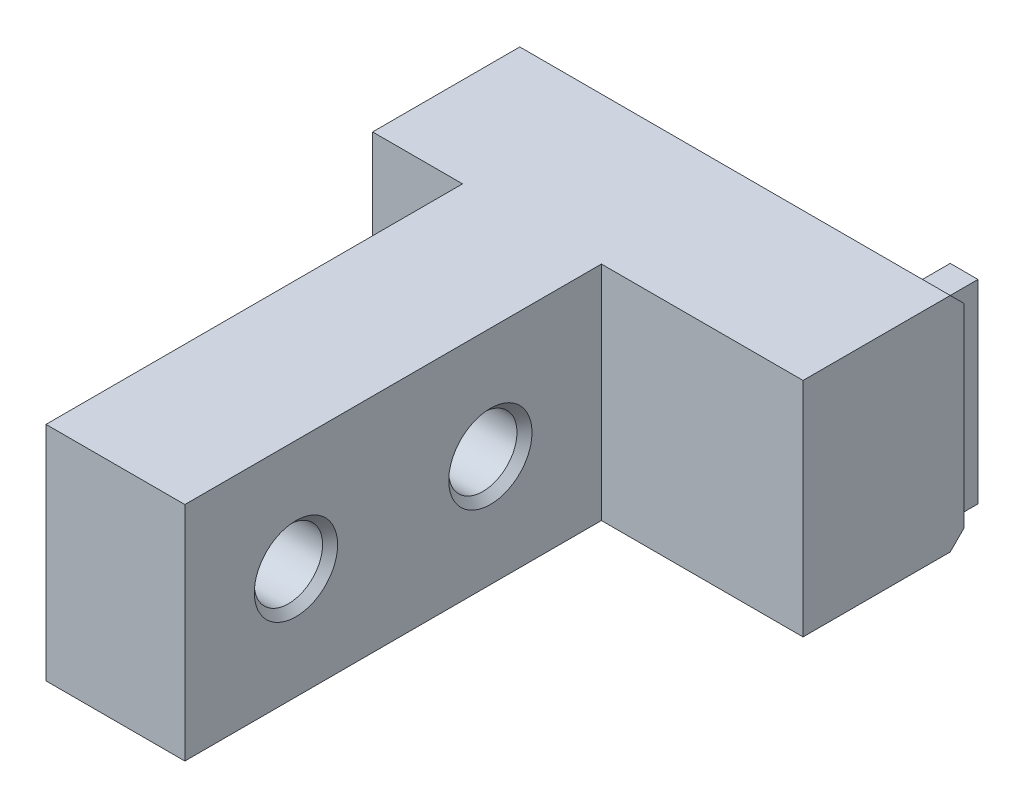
ISO-10303-21;
HEADER;
FILE_DESCRIPTION(('STEP AP214'),'2;1');
FILE_NAME('part.step','',(''),(''),'','','');
FILE_SCHEMA(('AUTOMOTIVE_DESIGN { 1 0 10303 214 1 1 1 1 }'));
ENDSEC;
DATA;
#1=APPLICATION_CONTEXT('core data for automotive mechanical design processes');
#2=APPLICATION_PROTOCOL_DEFINITION('international standard','automotive_design',2000,#1);
#3=PRODUCT_CONTEXT('',#1,'mechanical');
#4=PRODUCT('Part','Part','',(#3));
#5=PRODUCT_RELATED_PRODUCT_CATEGORY('part','',(#4));
#6=PRODUCT_DEFINITION_FORMATION('','',#4);
#7=PRODUCT_DEFINITION_CONTEXT('part definition',#1,'design');
#8=PRODUCT_DEFINITION('design','',#6,#7);
#9=PRODUCT_DEFINITION_SHAPE('','',#8);
#10=(LENGTH_UNIT() NAMED_UNIT(*) SI_UNIT(.MILLI.,.METRE.));
#11=(NAMED_UNIT(*) PLANE_ANGLE_UNIT() SI_UNIT($,.RADIAN.));
#12=(NAMED_UNIT(*) SI_UNIT($,.STERADIAN.) SOLID_ANGLE_UNIT());
#13=UNCERTAINTY_MEASURE_WITH_UNIT(LENGTH_MEASURE(1.E-05),#10,'distance_accuracy_value','');
#14=(GEOMETRIC_REPRESENTATION_CONTEXT(3) GLOBAL_UNCERTAINTY_ASSIGNED_CONTEXT((#13)) GLOBAL_UNIT_ASSIGNED_CONTEXT((#10,
#11,#12)) REPRESENTATION_CONTEXT('',''));
#15=CARTESIAN_POINT('',(0.,0.,0.));
#16=DIRECTION('',(0.,0.,1.));
#17=DIRECTION('',(1.,0.,0.));
#18=AXIS2_PLACEMENT_3D('',#15,#16,#17);
#19=CARTESIAN_POINT('',(-4.69,-3.5,-1.));
#20=DIRECTION('',(0.,0.,-1.));
#21=DIRECTION('',(-1.,0.,0.));
#22=AXIS2_PLACEMENT_3D('',#19,#20,#21);
#23=PLANE('',#22);
#24=DIRECTION('',(0.,1.,0.));
#25=VECTOR('',#24,1.);
#26=CARTESIAN_POINT('',(-4.69,0.,-1.));
#27=LINE('',#26,#25);
#28=CARTESIAN_POINT('',(-4.69,-3.5,-1.));
#29=VERTEX_POINT('',#28);
#30=CARTESIAN_POINT('',(-4.69,3.5,-1.));
#31=VERTEX_POINT('',#30);
#32=EDGE_CURVE('E120',#29,#31,#27,.T.);
#33=ORIENTED_EDGE('',*,*,#32,.T.);
#34=DIRECTION('',(-1.,0.,0.));
#35=VECTOR('',#34,1.);
#36=CARTESIAN_POINT('',(-4.69,3.5,-1.));
#37=LINE('',#36,#35);
#38=CARTESIAN_POINT('',(-3.69,3.5,-1.));
#39=VERTEX_POINT('',#38);
#40=EDGE_CURVE('E126',#31,#39,#37,.F.);
#41=ORIENTED_EDGE('',*,*,#40,.T.);
#42=DIRECTION('',(0.,1.,0.));
#43=VECTOR('',#42,1.);
#44=CARTESIAN_POINT('',(-3.69,0.,-1.));
#45=LINE('',#44,#43);
#46=CARTESIAN_POINT('',(-3.69,-3.5,-1.));
#47=VERTEX_POINT('',#46);
#48=EDGE_CURVE('E123',#47,#39,#45,.T.);
#49=ORIENTED_EDGE('',*,*,#48,.F.);
#50=DIRECTION('',(1.,0.,0.));
#51=VECTOR('',#50,1.);
#52=CARTESIAN_POINT('',(-4.69,-3.5,-1.));
#53=LINE('',#52,#51);
#54=EDGE_CURVE('E115',#29,#47,#53,.T.);
#55=ORIENTED_EDGE('',*,*,#54,.F.);
#56=EDGE_LOOP('',(#33,#41,#49,#55));
#57=FACE_BOUND('',#56,.T.);
#58=ADVANCED_FACE('F17',(#57),#23,.T.);
#59=CARTESIAN_POINT('',(-4.69,-3.5,0.));
#60=DIRECTION('',(0.,-1.,0.));
#61=DIRECTION('',(0.,0.,-1.));
#62=AXIS2_PLACEMENT_3D('',#59,#60,#61);
#63=PLANE('',#62);
#64=DIRECTION('',(0.,0.,-1.));
#65=VECTOR('',#64,1.);
#66=CARTESIAN_POINT('',(-4.69,-3.5,0.));
#67=LINE('',#66,#65);
#68=CARTESIAN_POINT('',(-4.69,-3.5,0.));
#69=VERTEX_POINT('',#68);
#70=EDGE_CURVE('E125',#69,#29,#67,.T.);
#71=ORIENTED_EDGE('',*,*,#70,.T.);
#72=ORIENTED_EDGE('',*,*,#54,.T.);
#73=DIRECTION('',(0.,0.,-1.));
#74=VECTOR('',#73,1.);
#75=CARTESIAN_POINT('',(-3.69,-3.5,0.));
#76=LINE('',#75,#74);
#77=CARTESIAN_POINT('',(-3.69,-3.5,0.));
#78=VERTEX_POINT('',#77);
#79=EDGE_CURVE('E139',#78,#47,#76,.T.);
#80=ORIENTED_EDGE('',*,*,#79,.F.);
#81=DIRECTION('',(1.,0.,0.));
#82=VECTOR('',#81,1.);
#83=CARTESIAN_POINT('',(-18.69,-3.5,0.));
#84=LINE('',#83,#82);
#85=EDGE_CURVE('E131',#78,#69,#84,.F.);
#86=ORIENTED_EDGE('',*,*,#85,.T.);
#87=EDGE_LOOP('',(#71,#72,#80,#86));
#88=FACE_BOUND('',#87,.T.);
#89=ADVANCED_FACE('F129',(#88),#63,.T.);
#90=CARTESIAN_POINT('',(-4.69,0.,0.));
#91=DIRECTION('',(1.,0.,0.));
#92=DIRECTION('',(0.,0.,-1.));
#93=AXIS2_PLACEMENT_3D('',#90,#91,#92);
#94=PLANE('',#93);
#95=DIRECTION('',(0.,0.,1.));
#96=VECTOR('',#95,1.);
#97=CARTESIAN_POINT('',(-4.69,3.5,-1.));
#98=LINE('',#97,#96);
#99=CARTESIAN_POINT('',(-4.69,3.5,0.));
#100=VERTEX_POINT('',#99);
#101=EDGE_CURVE('E138',#31,#100,#98,.T.);
#102=ORIENTED_EDGE('',*,*,#101,.F.);
#103=ORIENTED_EDGE('',*,*,#32,.F.);
#104=ORIENTED_EDGE('',*,*,#70,.F.);
#105=DIRECTION('',(0.,1.,0.));
#106=VECTOR('',#105,1.);
#107=CARTESIAN_POINT('',(-4.69,4.,0.));
#108=LINE('',#107,#106);
#109=EDGE_CURVE('E203',#69,#100,#108,.T.);
#110=ORIENTED_EDGE('',*,*,#109,.T.);
#111=EDGE_LOOP('',(#102,#103,#104,#110));
#112=FACE_BOUND('',#111,.T.);
#113=ADVANCED_FACE('F136',(#112),#94,.F.);
#114=CARTESIAN_POINT('',(-15.45,0.,16.8));
#115=DIRECTION('',(1.,0.,0.));
#116=DIRECTION('',(0.,0.,-1.));
#117=AXIS2_PLACEMENT_3D('',#114,#115,#116);
#118=CYLINDRICAL_SURFACE('',#117,1.2295);
#119=CARTESIAN_POINT('',(-15.1794999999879,0.,16.8));
#120=DIRECTION('',(-1.,0.,0.));
#121=DIRECTION('',(0.,0.,1.));
#122=AXIS2_PLACEMENT_3D('',#119,#120,#121);
#123=CIRCLE('',#122,1.22950000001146);
#124=CARTESIAN_POINT('',(-15.1794999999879,0.,18.0295000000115));
#125=VERTEX_POINT('',#124);
#126=EDGE_CURVE('E143',#125,#125,#123,.T.);
#127=ORIENTED_EDGE('',*,*,#126,.T.);
#128=EDGE_LOOP('',(#127));
#129=FACE_BOUND('',#128,.T.);
#130=CARTESIAN_POINT('',(-10.720499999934,0.,16.8));
#131=DIRECTION('',(1.,0.,0.));
#132=DIRECTION('',(0.,0.,-1.));
#133=AXIS2_PLACEMENT_3D('',#130,#131,#132);
#134=CIRCLE('',#133,1.22950000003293);
#135=CARTESIAN_POINT('',(-10.720499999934,0.,15.5704999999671));
#136=VERTEX_POINT('',#135);
#137=EDGE_CURVE('E219',#136,#136,#134,.T.);
#138=ORIENTED_EDGE('',*,*,#137,.T.);
#139=EDGE_LOOP('',(#138));
#140=FACE_BOUND('',#139,.T.);
#141=ADVANCED_FACE('F228',(#129,#140),#118,.F.);
#142=CARTESIAN_POINT('',(-15.45,0.,9.8));
#143=DIRECTION('',(1.,0.,0.));
#144=DIRECTION('',(0.,0.,-1.));
#145=AXIS2_PLACEMENT_3D('',#142,#143,#144);
#146=CYLINDRICAL_SURFACE('',#145,1.2295);
#147=CARTESIAN_POINT('',(-15.1794999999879,0.,9.8));
#148=DIRECTION('',(-1.,0.,0.));
#149=DIRECTION('',(0.,0.,1.));
#150=AXIS2_PLACEMENT_3D('',#147,#148,#149);
#151=CIRCLE('',#150,1.22950000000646);
#152=CARTESIAN_POINT('',(-15.1794999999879,0.,11.0295000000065));
#153=VERTEX_POINT('',#152);
#154=EDGE_CURVE('E221',#153,#153,#151,.T.);
#155=ORIENTED_EDGE('',*,*,#154,.T.);
#156=EDGE_LOOP('',(#155));
#157=FACE_BOUND('',#156,.T.);
#158=CARTESIAN_POINT('',(-10.720499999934,0.,9.8));
#159=DIRECTION('',(1.,0.,0.));
#160=DIRECTION('',(0.,0.,-1.));
#161=AXIS2_PLACEMENT_3D('',#158,#159,#160);
#162=CIRCLE('',#161,1.22950000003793);
#163=CARTESIAN_POINT('',(-10.720499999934,0.,8.57049999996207));
#164=VERTEX_POINT('',#163);
#165=EDGE_CURVE('E202',#164,#164,#162,.T.);
#166=ORIENTED_EDGE('',*,*,#165,.T.);
#167=EDGE_LOOP('',(#166));
#168=FACE_BOUND('',#167,.T.);
#169=ADVANCED_FACE('F307',(#157,#168),#146,.F.);
#170=CARTESIAN_POINT('',(-3.69,0.,0.));
#171=DIRECTION('',(1.,0.,0.));
#172=DIRECTION('',(0.,0.,-1.));
#173=AXIS2_PLACEMENT_3D('',#170,#171,#172);
#174=PLANE('',#173);
#175=ORIENTED_EDGE('',*,*,#48,.T.);
#176=DIRECTION('',(0.,0.,1.));
#177=VECTOR('',#176,1.);
#178=CARTESIAN_POINT('',(-3.69,3.5,-1.));
#179=LINE('',#178,#177);
#180=CARTESIAN_POINT('',(-3.69,3.5,0.));
#181=VERTEX_POINT('',#180);
#182=EDGE_CURVE('E208',#181,#39,#179,.F.);
#183=ORIENTED_EDGE('',*,*,#182,.F.);
#184=DIRECTION('',(0.,1.,0.));
#185=VECTOR('',#184,1.);
#186=CARTESIAN_POINT('',(-3.69,4.,0.));
#187=LINE('',#186,#185);
#188=EDGE_CURVE('E196',#181,#78,#187,.F.);
#189=ORIENTED_EDGE('',*,*,#188,.T.);
#190=ORIENTED_EDGE('',*,*,#79,.T.);
#191=EDGE_LOOP('',(#175,#183,#189,#190));
#192=FACE_BOUND('',#191,.T.);
#193=ADVANCED_FACE('F313',(#192),#174,.T.);
#194=CARTESIAN_POINT('',(-18.69,-3.5,0.));
#195=DIRECTION('',(0.,0.707106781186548,0.707106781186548));
#196=DIRECTION('',(0.,-0.707106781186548,0.707106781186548));
#197=AXIS2_PLACEMENT_3D('',#194,#195,#196);
#198=PLANE('',#197);
#199=DIRECTION('',(1.,0.,0.));
#200=VECTOR('',#199,1.);
#201=CARTESIAN_POINT('',(0.,-4.,0.5));
#202=LINE('',#201,#200);
#203=CARTESIAN_POINT('',(-3.19,-4.,0.5));
#204=VERTEX_POINT('',#203);
#205=CARTESIAN_POINT('',(-18.69,-4.,0.5));
#206=VERTEX_POINT('',#205);
#207=EDGE_CURVE('E193',#204,#206,#202,.F.);
#208=ORIENTED_EDGE('',*,*,#207,.T.);
#209=DIRECTION('',(0.,-0.707106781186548,0.707106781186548));
#210=VECTOR('',#209,1.);
#211=CARTESIAN_POINT('',(-18.69,-3.5,0.));
#212=LINE('',#211,#210);
#213=CARTESIAN_POINT('',(-18.69,-3.5,0.));
#214=VERTEX_POINT('',#213);
#215=EDGE_CURVE('E213',#214,#206,#212,.T.);
#216=ORIENTED_EDGE('',*,*,#215,.F.);
#217=DIRECTION('',(1.,0.,0.));
#218=VECTOR('',#217,1.);
#219=CARTESIAN_POINT('',(-3.19,-3.5,0.));
#220=LINE('',#219,#218);
#221=EDGE_CURVE('E205',#214,#69,#220,.T.);
#222=ORIENTED_EDGE('',*,*,#221,.T.);
#223=ORIENTED_EDGE('',*,*,#85,.F.);
#224=DIRECTION('',(1.,0.,0.));
#225=VECTOR('',#224,1.);
#226=CARTESIAN_POINT('',(-3.19,-3.5,0.));
#227=LINE('',#226,#225);
#228=CARTESIAN_POINT('',(-3.19,-3.5,0.));
#229=VERTEX_POINT('',#228);
#230=EDGE_CURVE('E199',#78,#229,#227,.T.);
#231=ORIENTED_EDGE('',*,*,#230,.T.);
#232=DIRECTION('',(0.,-0.707106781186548,0.707106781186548));
#233=VECTOR('',#232,1.);
#234=CARTESIAN_POINT('',(-3.18999999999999,-3.5,0.));
#235=LINE('',#234,#233);
#236=EDGE_CURVE('E211',#204,#229,#235,.F.);
#237=ORIENTED_EDGE('',*,*,#236,.F.);
#238=EDGE_LOOP('',(#208,#216,#222,#223,#231,#237));
#239=FACE_BOUND('',#238,.T.);
#240=ADVANCED_FACE('F358',(#239),#198,.F.);
#241=CARTESIAN_POINT('',(-4.69,3.5,-1.));
#242=DIRECTION('',(0.,1.,0.));
#243=DIRECTION('',(0.,0.,1.));
#244=AXIS2_PLACEMENT_3D('',#241,#242,#243);
#245=PLANE('',#244);
#246=ORIENTED_EDGE('',*,*,#101,.T.);
#247=DIRECTION('',(1.,0.,0.));
#248=VECTOR('',#247,1.);
#249=CARTESIAN_POINT('',(-18.69,3.5,0.));
#250=LINE('',#249,#248);
#251=EDGE_CURVE('E187',#100,#181,#250,.T.);
#252=ORIENTED_EDGE('',*,*,#251,.T.);
#253=ORIENTED_EDGE('',*,*,#182,.T.);
#254=ORIENTED_EDGE('',*,*,#40,.F.);
#255=EDGE_LOOP('',(#246,#252,#253,#254));
#256=FACE_BOUND('',#255,.T.);
#257=ADVANCED_FACE('F244',(#256),#245,.T.);
#258=CARTESIAN_POINT('',(-3.19,4.,0.));
#259=DIRECTION('',(0.,0.,1.));
#260=DIRECTION('',(1.,0.,0.));
#261=AXIS2_PLACEMENT_3D('',#258,#259,#260);
#262=PLANE('',#261);
#263=ORIENTED_EDGE('',*,*,#109,.F.);
#264=ORIENTED_EDGE('',*,*,#221,.F.);
#265=DIRECTION('',(0.,1.,0.));
#266=VECTOR('',#265,1.);
#267=CARTESIAN_POINT('',(-18.69,4.,0.));
#268=LINE('',#267,#266);
#269=CARTESIAN_POINT('',(-18.69,3.5,0.));
#270=VERTEX_POINT('',#269);
#271=EDGE_CURVE('E177',#214,#270,#268,.T.);
#272=ORIENTED_EDGE('',*,*,#271,.T.);
#273=DIRECTION('',(1.,0.,0.));
#274=VECTOR('',#273,1.);
#275=CARTESIAN_POINT('',(-18.69,3.5,0.));
#276=LINE('',#275,#274);
#277=EDGE_CURVE('E190',#270,#100,#276,.T.);
#278=ORIENTED_EDGE('',*,*,#277,.T.);
#279=EDGE_LOOP('',(#263,#264,#272,#278));
#280=FACE_BOUND('',#279,.T.);
#281=ADVANCED_FACE('F234',(#280),#262,.F.);
#282=CARTESIAN_POINT('',(-15.4500000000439,0.,16.8));
#283=DIRECTION('',(-1.,0.,0.));
#284=DIRECTION('',(0.,0.,1.));
#285=AXIS2_PLACEMENT_3D('',#282,#283,#284);
#286=CONICAL_SURFACE('',#285,1.50000000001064,0.785398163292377);
#287=CARTESIAN_POINT('',(-15.4500000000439,0.,16.8));
#288=DIRECTION('',(-1.,0.,0.));
#289=DIRECTION('',(0.,0.,1.));
#290=AXIS2_PLACEMENT_3D('',#287,#288,#289);
#291=CIRCLE('',#290,1.50000000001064);
#292=CARTESIAN_POINT('',(-15.4500000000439,0.,18.3000000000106));
#293=VERTEX_POINT('',#292);
#294=EDGE_CURVE('E20',#293,#293,#291,.T.);
#295=ORIENTED_EDGE('',*,*,#294,.T.);
#296=EDGE_LOOP('',(#295));
#297=FACE_BOUND('',#296,.T.);
#298=ORIENTED_EDGE('',*,*,#126,.F.);
#299=EDGE_LOOP('',(#298));
#300=FACE_BOUND('',#299,.T.);
#301=ADVANCED_FACE('F231',(#297,#300),#286,.F.);
#302=CARTESIAN_POINT('',(-15.4499999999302,0.,9.8));
#303=DIRECTION('',(-1.,0.,0.));
#304=DIRECTION('',(0.,0.,1.));
#305=AXIS2_PLACEMENT_3D('',#302,#303,#304);
#306=CONICAL_SURFACE('',#305,1.49999999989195,0.785398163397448);
#307=CARTESIAN_POINT('',(-15.4499999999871,0.,9.8));
#308=DIRECTION('',(-1.,0.,0.));
#309=DIRECTION('',(0.,0.,1.));
#310=AXIS2_PLACEMENT_3D('',#307,#308,#309);
#311=CIRCLE('',#310,1.49999999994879);
#312=CARTESIAN_POINT('',(-15.4499999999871,0.,11.2999999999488));
#313=VERTEX_POINT('',#312);
#314=EDGE_CURVE('E156',#313,#313,#311,.T.);
#315=ORIENTED_EDGE('',*,*,#314,.T.);
#316=EDGE_LOOP('',(#315));
#317=FACE_BOUND('',#316,.T.);
#318=ORIENTED_EDGE('',*,*,#154,.F.);
#319=EDGE_LOOP('',(#318));
#320=FACE_BOUND('',#319,.T.);
#321=ADVANCED_FACE('F233',(#317,#320),#306,.F.);
#322=CARTESIAN_POINT('',(-10.4499999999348,0.,16.8));
#323=DIRECTION('',(1.,0.,0.));
#324=DIRECTION('',(0.,0.,-1.));
#325=AXIS2_PLACEMENT_3D('',#322,#323,#324);
#326=CONICAL_SURFACE('',#325,1.50000000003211,0.785398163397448);
#327=ORIENTED_EDGE('',*,*,#137,.F.);
#328=EDGE_LOOP('',(#327));
#329=FACE_BOUND('',#328,.T.);
#330=CARTESIAN_POINT('',(-10.4499999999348,0.,16.8));
#331=DIRECTION('',(1.,0.,0.));
#332=DIRECTION('',(0.,0.,-1.));
#333=AXIS2_PLACEMENT_3D('',#330,#331,#332);
#334=CIRCLE('',#333,1.50000000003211);
#335=CARTESIAN_POINT('',(-10.4499999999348,0.,15.2999999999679));
#336=VERTEX_POINT('',#335);
#337=EDGE_CURVE('E152',#336,#336,#334,.T.);
#338=ORIENTED_EDGE('',*,*,#337,.T.);
#339=EDGE_LOOP('',(#338));
#340=FACE_BOUND('',#339,.T.);
#341=ADVANCED_FACE('F242',(#329,#340),#326,.F.);
#342=CARTESIAN_POINT('',(-10.4499999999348,0.,9.8));
#343=DIRECTION('',(1.,0.,0.));
#344=DIRECTION('',(0.,0.,-1.));
#345=AXIS2_PLACEMENT_3D('',#342,#343,#344);
#346=CONICAL_SURFACE('',#345,1.50000000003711,0.785398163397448);
#347=ORIENTED_EDGE('',*,*,#165,.F.);
#348=EDGE_LOOP('',(#347));
#349=FACE_BOUND('',#348,.T.);
#350=CARTESIAN_POINT('',(-10.4499999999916,0.,9.8));
#351=DIRECTION('',(1.,0.,0.));
#352=DIRECTION('',(0.,0.,-1.));
#353=AXIS2_PLACEMENT_3D('',#350,#351,#352);
#354=CIRCLE('',#353,1.49999999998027);
#355=CARTESIAN_POINT('',(-10.4499999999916,0.,8.30000000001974));
#356=VERTEX_POINT('',#355);
#357=EDGE_CURVE('E147',#356,#356,#354,.T.);
#358=ORIENTED_EDGE('',*,*,#357,.T.);
#359=EDGE_LOOP('',(#358));
#360=FACE_BOUND('',#359,.T.);
#361=ADVANCED_FACE('F293',(#349,#360),#346,.F.);
#362=CARTESIAN_POINT('',(-3.19,4.,0.));
#363=DIRECTION('',(0.,0.,1.));
#364=DIRECTION('',(1.,0.,0.));
#365=AXIS2_PLACEMENT_3D('',#362,#363,#364);
#366=PLANE('',#365);
#367=DIRECTION('',(1.,0.,0.));
#368=VECTOR('',#367,1.);
#369=CARTESIAN_POINT('',(-18.69,3.5,0.));
#370=LINE('',#369,#368);
#371=CARTESIAN_POINT('',(-3.19,3.5,0.));
#372=VERTEX_POINT('',#371);
#373=EDGE_CURVE('E185',#181,#372,#370,.T.);
#374=ORIENTED_EDGE('',*,*,#373,.T.);
#375=DIRECTION('',(0.,1.,0.));
#376=VECTOR('',#375,1.);
#377=CARTESIAN_POINT('',(-3.19,4.,0.));
#378=LINE('',#377,#376);
#379=EDGE_CURVE('E481',#372,#229,#378,.F.);
#380=ORIENTED_EDGE('',*,*,#379,.T.);
#381=ORIENTED_EDGE('',*,*,#230,.F.);
#382=ORIENTED_EDGE('',*,*,#188,.F.);
#383=EDGE_LOOP('',(#374,#380,#381,#382));
#384=FACE_BOUND('',#383,.T.);
#385=ADVANCED_FACE('F289',(#384),#366,.F.);
#386=CARTESIAN_POINT('',(0.,-4.,0.));
#387=DIRECTION('',(0.,1.,0.));
#388=DIRECTION('',(0.,0.,1.));
#389=AXIS2_PLACEMENT_3D('',#386,#387,#388);
#390=PLANE('',#389);
#391=ORIENTED_EDGE('',*,*,#207,.F.);
#392=DIRECTION('',(0.,0.,1.));
#393=VECTOR('',#392,1.);
#394=CARTESIAN_POINT('',(-3.19,-4.,5.8));
#395=LINE('',#394,#393);
#396=CARTESIAN_POINT('',(-3.19,-4.,5.8));
#397=VERTEX_POINT('',#396);
#398=EDGE_CURVE('E491',#204,#397,#395,.T.);
#399=ORIENTED_EDGE('',*,*,#398,.T.);
#400=DIRECTION('',(-1.,0.,0.));
#401=VECTOR('',#400,1.);
#402=CARTESIAN_POINT('',(-10.45,-4.,5.8));
#403=LINE('',#402,#401);
#404=CARTESIAN_POINT('',(-10.45,-4.,5.8));
#405=VERTEX_POINT('',#404);
#406=EDGE_CURVE('E150',#397,#405,#403,.T.);
#407=ORIENTED_EDGE('',*,*,#406,.T.);
#408=DIRECTION('',(0.,0.,1.));
#409=VECTOR('',#408,1.);
#410=CARTESIAN_POINT('',(-10.45,-4.,20.8));
#411=LINE('',#410,#409);
#412=CARTESIAN_POINT('',(-10.45,-4.,20.8));
#413=VERTEX_POINT('',#412);
#414=EDGE_CURVE('E154',#405,#413,#411,.T.);
#415=ORIENTED_EDGE('',*,*,#414,.T.);
#416=DIRECTION('',(-1.,0.,0.));
#417=VECTOR('',#416,1.);
#418=CARTESIAN_POINT('',(-15.45,-4.,20.8));
#419=LINE('',#418,#417);
#420=CARTESIAN_POINT('',(-15.45,-4.,20.8));
#421=VERTEX_POINT('',#420);
#422=EDGE_CURVE('E158',#413,#421,#419,.T.);
#423=ORIENTED_EDGE('',*,*,#422,.T.);
#424=DIRECTION('',(0.,0.,-1.));
#425=VECTOR('',#424,1.);
#426=CARTESIAN_POINT('',(-15.45,-4.,5.8));
#427=LINE('',#426,#425);
#428=CARTESIAN_POINT('',(-15.45,-4.,5.8));
#429=VERTEX_POINT('',#428);
#430=EDGE_CURVE('E163',#421,#429,#427,.T.);
#431=ORIENTED_EDGE('',*,*,#430,.T.);
#432=DIRECTION('',(-1.,0.,0.));
#433=VECTOR('',#432,1.);
#434=CARTESIAN_POINT('',(-18.69,-4.,5.8));
#435=LINE('',#434,#433);
#436=CARTESIAN_POINT('',(-18.69,-4.,5.8));
#437=VERTEX_POINT('',#436);
#438=EDGE_CURVE('E175',#429,#437,#435,.T.);
#439=ORIENTED_EDGE('',*,*,#438,.T.);
#440=DIRECTION('',(0.,0.,-1.));
#441=VECTOR('',#440,1.);
#442=CARTESIAN_POINT('',(-18.69,-4.,0.));
#443=LINE('',#442,#441);
#444=EDGE_CURVE('E180',#437,#206,#443,.T.);
#445=ORIENTED_EDGE('',*,*,#444,.T.);
#446=EDGE_LOOP('',(#391,#399,#407,#415,#423,#431,#439,#445));
#447=FACE_BOUND('',#446,.T.);
#448=ADVANCED_FACE('F285',(#447),#390,.F.);
#449=CARTESIAN_POINT('',(-18.69,4.,0.5));
#450=DIRECTION('',(0.,-0.707106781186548,0.707106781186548));
#451=DIRECTION('',(0.,-0.707106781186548,-0.707106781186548));
#452=AXIS2_PLACEMENT_3D('',#449,#450,#451);
#453=PLANE('',#452);
#454=ORIENTED_EDGE('',*,*,#373,.F.);
#455=ORIENTED_EDGE('',*,*,#251,.F.);
#456=ORIENTED_EDGE('',*,*,#277,.F.);
#457=DIRECTION('',(0.,0.707106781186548,0.707106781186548));
#458=VECTOR('',#457,1.);
#459=CARTESIAN_POINT('',(-18.69,3.5,0.));
#460=LINE('',#459,#458);
#461=CARTESIAN_POINT('',(-18.69,4.,0.5));
#462=VERTEX_POINT('',#461);
#463=EDGE_CURVE('E183',#270,#462,#460,.T.);
#464=ORIENTED_EDGE('',*,*,#463,.T.);
#465=DIRECTION('',(1.,0.,0.));
#466=VECTOR('',#465,1.);
#467=CARTESIAN_POINT('',(0.,4.,0.5));
#468=LINE('',#467,#466);
#469=CARTESIAN_POINT('',(-3.19,4.,0.5));
#470=VERTEX_POINT('',#469);
#471=EDGE_CURVE('E490',#470,#462,#468,.F.);
#472=ORIENTED_EDGE('',*,*,#471,.F.);
#473=DIRECTION('',(0.,-0.707106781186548,-0.707106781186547));
#474=VECTOR('',#473,1.);
#475=CARTESIAN_POINT('',(-3.19,4.,0.5));
#476=LINE('',#475,#474);
#477=EDGE_CURVE('E477',#470,#372,#476,.T.);
#478=ORIENTED_EDGE('',*,*,#477,.T.);
#479=EDGE_LOOP('',(#454,#455,#456,#464,#472,#478));
#480=FACE_BOUND('',#479,.T.);
#481=ADVANCED_FACE('F281',(#480),#453,.F.);
#482=CARTESIAN_POINT('',(-18.69,4.,0.));
#483=DIRECTION('',(1.,0.,0.));
#484=DIRECTION('',(0.,0.,-1.));
#485=AXIS2_PLACEMENT_3D('',#482,#483,#484);
#486=PLANE('',#485);
#487=ORIENTED_EDGE('',*,*,#215,.T.);
#488=ORIENTED_EDGE('',*,*,#444,.F.);
#489=DIRECTION('',(0.,1.,0.));
#490=VECTOR('',#489,1.);
#491=CARTESIAN_POINT('',(-18.69,4.,5.8));
#492=LINE('',#491,#490);
#493=CARTESIAN_POINT('',(-18.69,4.,5.8));
#494=VERTEX_POINT('',#493);
#495=EDGE_CURVE('E173',#437,#494,#492,.T.);
#496=ORIENTED_EDGE('',*,*,#495,.T.);
#497=DIRECTION('',(0.,0.,1.));
#498=VECTOR('',#497,1.);
#499=CARTESIAN_POINT('',(-18.69,4.,0.));
#500=LINE('',#499,#498);
#501=EDGE_CURVE('E488',#462,#494,#500,.T.);
#502=ORIENTED_EDGE('',*,*,#501,.F.);
#503=ORIENTED_EDGE('',*,*,#463,.F.);
#504=ORIENTED_EDGE('',*,*,#271,.F.);
#505=EDGE_LOOP('',(#487,#488,#496,#502,#503,#504));
#506=FACE_BOUND('',#505,.T.);
#507=ADVANCED_FACE('F278',(#506),#486,.F.);
#508=CARTESIAN_POINT('',(-18.69,4.,5.8));
#509=DIRECTION('',(0.,0.,-1.));
#510=DIRECTION('',(-1.,0.,0.));
#511=AXIS2_PLACEMENT_3D('',#508,#509,#510);
#512=PLANE('',#511);
#513=ORIENTED_EDGE('',*,*,#438,.F.);
#514=DIRECTION('',(0.,1.,0.));
#515=VECTOR('',#514,1.);
#516=CARTESIAN_POINT('',(-15.45,4.,5.8));
#517=LINE('',#516,#515);
#518=CARTESIAN_POINT('',(-15.45,4.,5.8));
#519=VERTEX_POINT('',#518);
#520=EDGE_CURVE('E159',#429,#519,#517,.T.);
#521=ORIENTED_EDGE('',*,*,#520,.T.);
#522=DIRECTION('',(1.,0.,0.));
#523=VECTOR('',#522,1.);
#524=CARTESIAN_POINT('',(0.,4.,5.8));
#525=LINE('',#524,#523);
#526=EDGE_CURVE('E507',#494,#519,#525,.T.);
#527=ORIENTED_EDGE('',*,*,#526,.F.);
#528=ORIENTED_EDGE('',*,*,#495,.F.);
#529=EDGE_LOOP('',(#513,#521,#527,#528));
#530=FACE_BOUND('',#529,.T.);
#531=ADVANCED_FACE('F274',(#530),#512,.F.);
#532=CARTESIAN_POINT('',(-15.45,4.,5.8));
#533=DIRECTION('',(1.,0.,0.));
#534=DIRECTION('',(0.,0.,-1.));
#535=AXIS2_PLACEMENT_3D('',#532,#533,#534);
#536=PLANE('',#535);
#537=ORIENTED_EDGE('',*,*,#314,.F.);
#538=EDGE_LOOP('',(#537));
#539=FACE_BOUND('',#538,.T.);
#540=ORIENTED_EDGE('',*,*,#430,.F.);
#541=DIRECTION('',(0.,1.,0.));
#542=VECTOR('',#541,1.);
#543=CARTESIAN_POINT('',(-15.45,4.,20.8));
#544=LINE('',#543,#542);
#545=CARTESIAN_POINT('',(-15.45,4.,20.8));
#546=VERTEX_POINT('',#545);
#547=EDGE_CURVE('E155',#421,#546,#544,.T.);
#548=ORIENTED_EDGE('',*,*,#547,.T.);
#549=DIRECTION('',(0.,0.,1.));
#550=VECTOR('',#549,1.);
#551=CARTESIAN_POINT('',(-15.45,4.,0.));
#552=LINE('',#551,#550);
#553=EDGE_CURVE('E504',#519,#546,#552,.T.);
#554=ORIENTED_EDGE('',*,*,#553,.F.);
#555=ORIENTED_EDGE('',*,*,#520,.F.);
#556=EDGE_LOOP('',(#540,#548,#554,#555));
#557=FACE_BOUND('',#556,.T.);
#558=ORIENTED_EDGE('',*,*,#294,.F.);
#559=EDGE_LOOP('',(#558));
#560=FACE_BOUND('',#559,.T.);
#561=ADVANCED_FACE('F270',(#539,#557,#560),#536,.F.);
#562=CARTESIAN_POINT('',(-15.45,4.,20.8));
#563=DIRECTION('',(0.,0.,-1.));
#564=DIRECTION('',(-1.,0.,0.));
#565=AXIS2_PLACEMENT_3D('',#562,#563,#564);
#566=PLANE('',#565);
#567=ORIENTED_EDGE('',*,*,#422,.F.);
#568=DIRECTION('',(0.,1.,0.));
#569=VECTOR('',#568,1.);
#570=CARTESIAN_POINT('',(-10.45,4.,20.8));
#571=LINE('',#570,#569);
#572=CARTESIAN_POINT('',(-10.45,4.,20.8));
#573=VERTEX_POINT('',#572);
#574=EDGE_CURVE('E151',#413,#573,#571,.T.);
#575=ORIENTED_EDGE('',*,*,#574,.T.);
#576=DIRECTION('',(1.,0.,0.));
#577=VECTOR('',#576,1.);
#578=CARTESIAN_POINT('',(0.,4.,20.8));
#579=LINE('',#578,#577);
#580=EDGE_CURVE('E500',#546,#573,#579,.T.);
#581=ORIENTED_EDGE('',*,*,#580,.F.);
#582=ORIENTED_EDGE('',*,*,#547,.F.);
#583=EDGE_LOOP('',(#567,#575,#581,#582));
#584=FACE_BOUND('',#583,.T.);
#585=ADVANCED_FACE('F266',(#584),#566,.F.);
#586=CARTESIAN_POINT('',(-10.45,4.,20.8));
#587=DIRECTION('',(-1.,0.,0.));
#588=DIRECTION('',(0.,0.,1.));
#589=AXIS2_PLACEMENT_3D('',#586,#587,#588);
#590=PLANE('',#589);
#591=ORIENTED_EDGE('',*,*,#357,.F.);
#592=EDGE_LOOP('',(#591));
#593=FACE_BOUND('',#592,.T.);
#594=ORIENTED_EDGE('',*,*,#414,.F.);
#595=DIRECTION('',(0.,1.,0.));
#596=VECTOR('',#595,1.);
#597=CARTESIAN_POINT('',(-10.45,4.,5.8));
#598=LINE('',#597,#596);
#599=CARTESIAN_POINT('',(-10.45,4.,5.8));
#600=VERTEX_POINT('',#599);
#601=EDGE_CURVE('E515',#405,#600,#598,.T.);
#602=ORIENTED_EDGE('',*,*,#601,.T.);
#603=DIRECTION('',(0.,0.,1.));
#604=VECTOR('',#603,1.);
#605=CARTESIAN_POINT('',(-10.45,4.,0.));
#606=LINE('',#605,#604);
#607=EDGE_CURVE('E497',#573,#600,#606,.F.);
#608=ORIENTED_EDGE('',*,*,#607,.F.);
#609=ORIENTED_EDGE('',*,*,#574,.F.);
#610=EDGE_LOOP('',(#594,#602,#608,#609));
#611=FACE_BOUND('',#610,.T.);
#612=ORIENTED_EDGE('',*,*,#337,.F.);
#613=EDGE_LOOP('',(#612));
#614=FACE_BOUND('',#613,.T.);
#615=ADVANCED_FACE('F263',(#593,#611,#614),#590,.F.);
#616=CARTESIAN_POINT('',(-10.45,4.,5.8));
#617=DIRECTION('',(0.,0.,-1.));
#618=DIRECTION('',(-1.,0.,0.));
#619=AXIS2_PLACEMENT_3D('',#616,#617,#618);
#620=PLANE('',#619);
#621=ORIENTED_EDGE('',*,*,#406,.F.);
#622=DIRECTION('',(0.,1.,0.));
#623=VECTOR('',#622,1.);
#624=CARTESIAN_POINT('',(-3.19,4.,5.8));
#625=LINE('',#624,#623);
#626=CARTESIAN_POINT('',(-3.19,4.,5.8));
#627=VERTEX_POINT('',#626);
#628=EDGE_CURVE('E35',#397,#627,#625,.T.);
#629=ORIENTED_EDGE('',*,*,#628,.T.);
#630=DIRECTION('',(1.,0.,0.));
#631=VECTOR('',#630,1.);
#632=CARTESIAN_POINT('',(0.,4.,5.8));
#633=LINE('',#632,#631);
#634=EDGE_CURVE('E26',#600,#627,#633,.T.);
#635=ORIENTED_EDGE('',*,*,#634,.F.);
#636=ORIENTED_EDGE('',*,*,#601,.F.);
#637=EDGE_LOOP('',(#621,#629,#635,#636));
#638=FACE_BOUND('',#637,.T.);
#639=ADVANCED_FACE('F256',(#638),#620,.F.);
#640=CARTESIAN_POINT('',(-3.19,4.,5.8));
#641=DIRECTION('',(-1.,0.,0.));
#642=DIRECTION('',(0.,0.,1.));
#643=AXIS2_PLACEMENT_3D('',#640,#641,#642);
#644=PLANE('',#643);
#645=ORIENTED_EDGE('',*,*,#236,.T.);
#646=ORIENTED_EDGE('',*,*,#379,.F.);
#647=ORIENTED_EDGE('',*,*,#477,.F.);
#648=DIRECTION('',(0.,0.,1.));
#649=VECTOR('',#648,1.);
#650=CARTESIAN_POINT('',(-3.19,4.,0.));
#651=LINE('',#650,#649);
#652=EDGE_CURVE('E11',#627,#470,#651,.F.);
#653=ORIENTED_EDGE('',*,*,#652,.F.);
#654=ORIENTED_EDGE('',*,*,#628,.F.);
#655=ORIENTED_EDGE('',*,*,#398,.F.);
#656=EDGE_LOOP('',(#645,#646,#647,#653,#654,#655));
#657=FACE_BOUND('',#656,.T.);
#658=ADVANCED_FACE('F250',(#657),#644,.F.);
#659=CARTESIAN_POINT('',(0.,4.,0.));
#660=DIRECTION('',(0.,1.,0.));
#661=DIRECTION('',(0.,0.,1.));
#662=AXIS2_PLACEMENT_3D('',#659,#660,#661);
#663=PLANE('',#662);
#664=ORIENTED_EDGE('',*,*,#634,.T.);
#665=ORIENTED_EDGE('',*,*,#652,.T.);
#666=ORIENTED_EDGE('',*,*,#471,.T.);
#667=ORIENTED_EDGE('',*,*,#501,.T.);
#668=ORIENTED_EDGE('',*,*,#526,.T.);
#669=ORIENTED_EDGE('',*,*,#553,.T.);
#670=ORIENTED_EDGE('',*,*,#580,.T.);
#671=ORIENTED_EDGE('',*,*,#607,.T.);
#672=EDGE_LOOP('',(#664,#665,#666,#667,#668,#669,#670,#671));
#673=FACE_BOUND('',#672,.T.);
#674=ADVANCED_FACE('F248',(#673),#663,.T.);
#675=CLOSED_SHELL('',(#58,#89,#113,#141,#169,#193,#240,#257,#281,#301,#321,#341,#361,#385,#448,
#481,#507,#531,#561,#585,#615,#639,#658,#674));
#676=MANIFOLD_SOLID_BREP('B1',#675);
#677=ADVANCED_BREP_SHAPE_REPRESENTATION('',(#18,#676),#14);
#678=SHAPE_DEFINITION_REPRESENTATION(#9,#677);
ENDSEC;
END-ISO-10303-21;
